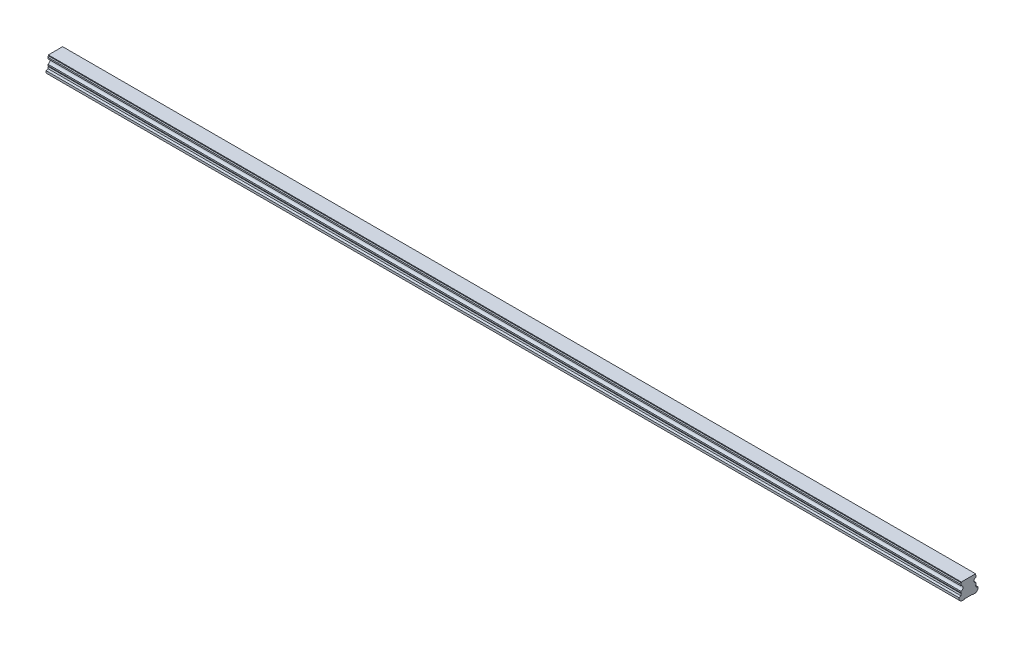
from build123d import *

# Parameters (mm, degrees)
BOSS_EXTRUDE1_DEPTH        = 1200
SKETCH3_R                  = 3
SKETCH3_R_2                = 2.5
CUT_EXTRUDE3_DEPTH         = 12
SKETCH3_2_R                = 2.5
CUT_EXTRUDE4_DEPTH         = 15
CHAMFER1_SIZE              = 0.5
LPATTERN4_COUNT            = 20
LPATTERN4_PITCH            = 60
CHAMFER1_OF_LPATTERN4_SIZE = 0.5


with BuildPart() as part:
    # Sketch1 → Boss-Extrude1 (new body)
    with BuildSketch(Plane(origin=(0, 0, 0), x_dir=(0, 0, -1), z_dir=(1, 0, 0))):
        with BuildLine():
            Line((9.375, 21.8), (-9.375, 21.8))
            Line((-9.375, 21.8), (-9.375, 20.756))
            Line((-9.375, 20.756), (-10, 19.415683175))
            Line((-10, 19.415683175), (-10, 17.685449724))
            ThreePointArc((-10, 17.685449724), (-7.2, 14.6), (-10, 11.514550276))
            Line((-10, 11.514550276), (-10, 9.784316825))
            Line((-10, 9.784316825), (-9.375, 8.444))
            Line((-9.375, 8.444), (-9.922688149, 6.4))
            Line((-9.922688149, 6.4), (-12.5, 5.489338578))
            Line((-12.5, 5.489338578), (-12.5, 2.65))
            Line((-12.5, 2.65), (-9.85, 0))
            Line((-9.85, 0), (-5.5, 0))
            Line((-5.5, 0), (-5, 0.5))
            Line((-5, 0.5), (5, 0.5))
            Line((5, 0.5), (5.5, 0))
            Line((5.5, 0), (9.85, 0))
            Line((9.85, 0), (12.5, 2.65))
            Line((12.5, 2.65), (12.5, 5.489338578))
            Line((12.5, 5.489338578), (9.922688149, 6.4))
            Line((9.922688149, 6.4), (9.375, 8.444))
            Line((9.375, 8.444), (10, 9.784316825))
            Line((10, 9.784316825), (10, 11.514550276))
            ThreePointArc((10, 11.514550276), (7.2, 14.6), (10, 17.685449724))
            Line((10, 17.685449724), (10, 19.415683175))
            Line((10, 19.415683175), (9.375, 20.756))
            Line((9.375, 20.756), (9.375, 21.8))
        make_face()
    extrude(amount=BOSS_EXTRUDE1_DEPTH)

    # Sketch3 → Cut-Extrude3 (cut)
    with BuildSketch(Plane.XZ):
        with Locations(Location((30, 0, 0), (0, 0, 270))):
            Circle(SKETCH3_R)
        with Locations(Location((30, 0, 0), (0, 0, 270))):
            Circle(SKETCH3_R_2, mode=Mode.SUBTRACT)
    cut_extrude3 = extrude(amount=-CUT_EXTRUDE3_DEPTH, mode=Mode.SUBTRACT)

    # Sketch3_2 → Cut-Extrude4 (cut)
    with BuildSketch(Plane.XZ):
        with Locations(Location((30, 0, 0), (0, 0, 270))):
            Circle(SKETCH3_2_R)
    cut_extrude4 = extrude(amount=-CUT_EXTRUDE4_DEPTH, mode=Mode.SUBTRACT)

    # Cut-Extrude5 cone 1 section (on through the dimple's axis) → Cut-Extrude5 (revolve, cut)
    with BuildSketch(Plane(origin=(30, 15, 0), x_dir=(0, 0, -1), z_dir=(1, 0, 0))):
        Polygon((0, 0), (2.5, 0), (0, 1.443375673), align=None)
    cut_extrude5 = revolve(axis=Axis((30, 15, 0), (0, 1, 0)), mode=Mode.SUBTRACT)

    # Chamfer1
    chamfer1_edges = [part.edges().sort_by_distance(p)[0] for p in [
        (30, 0.5, 3),
    ]]
    chamfer(chamfer1_edges, length=CHAMFER1_SIZE)

    # LPattern4: Cut-Extrude3, Cut-Extrude4, Cut-Extrude5 ×20
    with Locations(*[(i * LPATTERN4_PITCH, 0, 0) for i in range(1, LPATTERN4_COUNT)]):
        add(cut_extrude3, mode=Mode.SUBTRACT)
        add(cut_extrude4, mode=Mode.SUBTRACT)
        add(cut_extrude5, mode=Mode.SUBTRACT)

    # Chamfer1 of LPattern4
    chamfer1_of_lpattern4_edges = [part.edges().sort_by_distance(p)[0] for p in [
        (90, 0.5, 3),
        (150, 0.5, 3),
        (210, 0.5, 3),
        (270, 0.5, 3),
        (330, 0.5, 3),
        (390, 0.5, 3),
        (450, 0.5, 3),
        (510, 0.5, 3),
        (570, 0.5, 3),
        (630, 0.5, 3),
        (690, 0.5, 3),
        (750, 0.5, 3),
        (810, 0.5, 3),
        (870, 0.5, 3),
        (930, 0.5, 3),
        (990, 0.5, 3),
        (1050, 0.5, 3),
        (1110, 0.5, 3),
        (1170, 0.5, 3),
    ]]
    chamfer(chamfer1_of_lpattern4_edges, length=CHAMFER1_OF_LPATTERN4_SIZE)


solid = part.part
